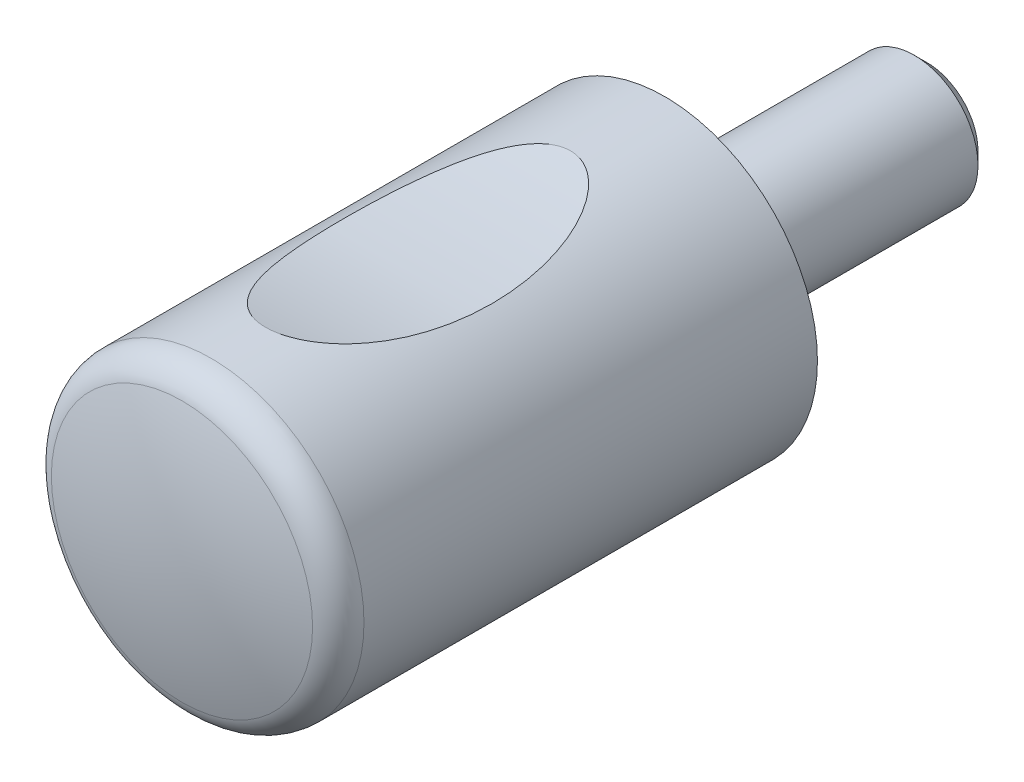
ISO-10303-21;
HEADER;
FILE_DESCRIPTION(('STEP AP214'),'2;1');
FILE_NAME('part.step','',(''),(''),'','','');
FILE_SCHEMA(('AUTOMOTIVE_DESIGN { 1 0 10303 214 1 1 1 1 }'));
ENDSEC;
DATA;
#1=APPLICATION_CONTEXT('core data for automotive mechanical design processes');
#2=APPLICATION_PROTOCOL_DEFINITION('international standard','automotive_design',2000,#1);
#3=PRODUCT_CONTEXT('',#1,'mechanical');
#4=PRODUCT('Part','Part','',(#3));
#5=PRODUCT_RELATED_PRODUCT_CATEGORY('part','',(#4));
#6=PRODUCT_DEFINITION_FORMATION('','',#4);
#7=PRODUCT_DEFINITION_CONTEXT('part definition',#1,'design');
#8=PRODUCT_DEFINITION('design','',#6,#7);
#9=PRODUCT_DEFINITION_SHAPE('','',#8);
#10=(LENGTH_UNIT() NAMED_UNIT(*) SI_UNIT(.MILLI.,.METRE.));
#11=(NAMED_UNIT(*) PLANE_ANGLE_UNIT() SI_UNIT($,.RADIAN.));
#12=(NAMED_UNIT(*) SI_UNIT($,.STERADIAN.) SOLID_ANGLE_UNIT());
#13=UNCERTAINTY_MEASURE_WITH_UNIT(LENGTH_MEASURE(1.E-05),#10,'distance_accuracy_value','');
#14=(GEOMETRIC_REPRESENTATION_CONTEXT(3) GLOBAL_UNCERTAINTY_ASSIGNED_CONTEXT((#13)) GLOBAL_UNIT_ASSIGNED_CONTEXT((#10,
#11,#12)) REPRESENTATION_CONTEXT('',''));
#15=CARTESIAN_POINT('',(0.,0.,0.));
#16=DIRECTION('',(0.,0.,1.));
#17=DIRECTION('',(1.,0.,0.));
#18=AXIS2_PLACEMENT_3D('',#15,#16,#17);
#19=CARTESIAN_POINT('',(0.,0.,20.));
#20=DIRECTION('',(0.,0.,1.));
#21=DIRECTION('',(1.,0.,0.));
#22=AXIS2_PLACEMENT_3D('',#19,#20,#21);
#23=CYLINDRICAL_SURFACE('',#22,6.);
#24=CARTESIAN_POINT('',(0.,0.,18.1207701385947));
#25=DIRECTION('',(0.,0.,1.));
#26=DIRECTION('',(1.,0.,0.));
#27=AXIS2_PLACEMENT_3D('',#24,#25,#26);
#28=CIRCLE('',#27,6.);
#29=CARTESIAN_POINT('',(6.,0.,18.1207701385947));
#30=VERTEX_POINT('',#29);
#31=EDGE_CURVE('E188',#30,#30,#28,.T.);
#32=ORIENTED_EDGE('',*,*,#31,.F.);
#33=EDGE_LOOP('',(#32));
#34=FACE_BOUND('',#33,.T.);
#35=CARTESIAN_POINT('',(0.,-6.,16.));
#36=CARTESIAN_POINT('',(-0.0885084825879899,-5.99999888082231,15.9999963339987));
#37=CARTESIAN_POINT('',(-0.177033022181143,-5.99802005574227,15.9922201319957));
#38=CARTESIAN_POINT('',(-0.35133626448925,-5.99034204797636,15.9618621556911));
#39=CARTESIAN_POINT('',(-0.43711286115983,-5.98464008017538,15.9392692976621));
#40=CARTESIAN_POINT('',(-0.603236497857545,-5.97017791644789,15.8814015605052));
#41=CARTESIAN_POINT('',(-0.683617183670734,-5.96143929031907,15.8462160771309));
#42=CARTESIAN_POINT('',(-0.838570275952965,-5.94162524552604,15.7654247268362));
#43=CARTESIAN_POINT('',(-0.913140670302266,-5.93054902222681,15.7198152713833));
#44=CARTESIAN_POINT('',(-1.10695132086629,-5.89830994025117,15.5850122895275));
#45=CARTESIAN_POINT('',(-1.22037159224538,-5.87556399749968,15.4878466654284));
#46=CARTESIAN_POINT('',(-1.43073393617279,-5.82792436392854,15.2774555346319));
#47=CARTESIAN_POINT('',(-1.52762016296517,-5.80302380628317,15.1641778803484));
#48=CARTESIAN_POINT('',(-1.69569048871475,-5.75597333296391,14.9418087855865));
#49=CARTESIAN_POINT('',(-1.76857378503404,-5.73386932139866,14.8339686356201));
#50=CARTESIAN_POINT('',(-1.90476176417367,-5.69007946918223,14.6122647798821));
#51=CARTESIAN_POINT('',(-1.96805898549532,-5.66839396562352,14.4983964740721));
#52=CARTESIAN_POINT('',(-2.08633341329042,-5.62593657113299,14.2660924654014));
#53=CARTESIAN_POINT('',(-2.14129910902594,-5.60516597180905,14.1476507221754));
#54=CARTESIAN_POINT('',(-2.24383352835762,-5.56491065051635,13.9073767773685));
#55=CARTESIAN_POINT('',(-2.29139954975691,-5.54542639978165,13.7855433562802));
#56=CARTESIAN_POINT('',(-2.41879687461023,-5.49159792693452,13.4313314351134));
#57=CARTESIAN_POINT('',(-2.49036250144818,-5.45919907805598,13.1956660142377));
#58=CARTESIAN_POINT('',(-2.61441516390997,-5.40087665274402,12.7185312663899));
#59=CARTESIAN_POINT('',(-2.66688604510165,-5.37495856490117,12.477057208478));
#60=CARTESIAN_POINT('',(-2.75538443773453,-5.33013287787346,11.9899723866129));
#61=CARTESIAN_POINT('',(-2.79137692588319,-5.31124022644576,11.7443539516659));
#62=CARTESIAN_POINT('',(-2.8484076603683,-5.28087145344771,11.2510432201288));
#63=CARTESIAN_POINT('',(-2.86945046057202,-5.2693930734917,11.0033515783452));
#64=CARTESIAN_POINT('',(-2.89873394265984,-5.25334667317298,10.4856281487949));
#65=CARTESIAN_POINT('',(-2.90572029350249,-5.24945660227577,10.2155042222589));
#66=CARTESIAN_POINT('',(-2.90353357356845,-5.25066575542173,9.67527182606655));
#67=CARTESIAN_POINT('',(-2.89435603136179,-5.25576746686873,9.40516338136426));
#68=CARTESIAN_POINT('',(-2.85942613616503,-5.27485410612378,8.86721784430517));
#69=CARTESIAN_POINT('',(-2.83372915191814,-5.28880935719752,8.59937618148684));
#70=CARTESIAN_POINT('',(-2.76450129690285,-5.32532347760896,8.0667184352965));
#71=CARTESIAN_POINT('',(-2.72097995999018,-5.34787774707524,7.8019008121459));
#72=CARTESIAN_POINT('',(-2.6148720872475,-5.40054921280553,7.28282189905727));
#73=CARTESIAN_POINT('',(-2.55272305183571,-5.43049033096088,7.02845639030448));
#74=CARTESIAN_POINT('',(-2.44216041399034,-5.48064370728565,6.65234346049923));
#75=CARTESIAN_POINT('',(-2.40234382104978,-5.49826538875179,6.52769619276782));
#76=CARTESIAN_POINT('',(-2.31627495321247,-5.53507666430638,6.28089251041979));
#77=CARTESIAN_POINT('',(-2.2700243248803,-5.55426585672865,6.15873546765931));
#78=CARTESIAN_POINT('',(-2.16968626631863,-5.59423046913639,5.9161243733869));
#79=CARTESIAN_POINT('',(-2.1155094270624,-5.61502249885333,5.79570975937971));
#80=CARTESIAN_POINT('',(-1.99870648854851,-5.65765364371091,5.55912422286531));
#81=CARTESIAN_POINT('',(-1.93607628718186,-5.67949326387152,5.44295539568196));
#82=CARTESIAN_POINT('',(-1.80147814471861,-5.72360661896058,5.21698841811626));
#83=CARTESIAN_POINT('',(-1.72955814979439,-5.74587765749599,5.10716147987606));
#84=CARTESIAN_POINT('',(-1.57477160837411,-5.79021374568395,4.89556756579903));
#85=CARTESIAN_POINT('',(-1.49192114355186,-5.81227904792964,4.79378909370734));
#86=CARTESIAN_POINT('',(-1.3292474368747,-5.85139401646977,4.61828011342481));
#87=CARTESIAN_POINT('',(-1.25142664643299,-5.8686461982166,4.54275669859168));
#88=CARTESIAN_POINT('',(-1.08642654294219,-5.90141932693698,4.40200371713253));
#89=CARTESIAN_POINT('',(-0.99924299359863,-5.9169394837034,4.33677884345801));
#90=CARTESIAN_POINT('',(-0.814239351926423,-5.94523918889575,4.21958141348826));
#91=CARTESIAN_POINT('',(-0.716301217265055,-5.9579825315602,4.16778243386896));
#92=CARTESIAN_POINT('',(-0.512085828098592,-5.97897963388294,4.0832197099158));
#93=CARTESIAN_POINT('',(-0.405830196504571,-5.98724461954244,4.05040835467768));
#94=CARTESIAN_POINT('',(-0.214619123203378,-5.99673247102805,4.01285794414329));
#95=CARTESIAN_POINT('',(-0.130668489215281,-5.99916902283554,4.00327291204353));
#96=CARTESIAN_POINT('',(0.0376884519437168,-6.00047075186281,3.99814556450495));
#97=CARTESIAN_POINT('',(0.122094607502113,-5.99933705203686,4.00259883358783));
#98=CARTESIAN_POINT('',(0.288704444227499,-5.99362939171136,4.02512989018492));
#99=CARTESIAN_POINT('',(0.370912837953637,-5.98906352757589,4.04317561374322));
#100=CARTESIAN_POINT('',(0.531437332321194,-5.97696188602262,4.09140204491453));
#101=CARTESIAN_POINT('',(0.609750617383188,-5.96942399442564,4.12159139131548));
#102=CARTESIAN_POINT('',(0.792980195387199,-5.94835106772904,4.20693915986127));
#103=CARTESIAN_POINT('',(0.895344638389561,-5.93362618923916,4.26725992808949));
#104=CARTESIAN_POINT('',(1.08894848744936,-5.90117761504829,4.4030591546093));
#105=CARTESIAN_POINT('',(1.18016058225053,-5.88344680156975,4.47857367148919));
#106=CARTESIAN_POINT('',(1.33472334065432,-5.85008083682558,4.62428816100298));
#107=CARTESIAN_POINT('',(1.40000393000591,-5.83473221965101,4.69254823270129));
#108=CARTESIAN_POINT('',(1.52426881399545,-5.80350772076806,4.83449592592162));
#109=CARTESIAN_POINT('',(1.58324910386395,-5.78763151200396,4.90818694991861));
#110=CARTESIAN_POINT('',(1.75175341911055,-5.73978249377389,5.13575119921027));
#111=CARTESIAN_POINT('',(1.85268549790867,-5.70762538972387,5.29596063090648));
#112=CARTESIAN_POINT('',(2.02917312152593,-5.64716355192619,5.61495923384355));
#113=CARTESIAN_POINT('',(2.10602364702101,-5.61874753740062,5.77303766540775));
#114=CARTESIAN_POINT('',(2.24621788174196,-5.5641856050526,6.09556739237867));
#115=CARTESIAN_POINT('',(2.30955019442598,-5.53804161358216,6.26002392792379));
#116=CARTESIAN_POINT('',(2.42470146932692,-5.48860162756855,6.59362294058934));
#117=CARTESIAN_POINT('',(2.47649921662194,-5.46531091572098,6.76277341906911));
#118=CARTESIAN_POINT('',(2.56992912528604,-5.42200101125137,7.1042907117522));
#119=CARTESIAN_POINT('',(2.6115580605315,-5.40198285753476,7.27665852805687));
#120=CARTESIAN_POINT('',(2.71249141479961,-5.35234018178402,7.74865687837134));
#121=CARTESIAN_POINT('',(2.76294374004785,-5.32617557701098,8.05056680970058));
#122=CARTESIAN_POINT('',(2.84079365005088,-5.28505089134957,8.65820096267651));
#123=CARTESIAN_POINT('',(2.86817404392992,-5.2700991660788,8.96392785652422));
#124=CARTESIAN_POINT('',(2.901664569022,-5.25173348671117,9.57723455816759));
#125=CARTESIAN_POINT('',(2.90774965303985,-5.24833311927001,9.88481612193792));
#126=CARTESIAN_POINT('',(2.89898713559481,-5.25318143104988,10.49945776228));
#127=CARTESIAN_POINT('',(2.88415027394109,-5.2614241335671,10.8065180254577));
#128=CARTESIAN_POINT('',(2.83955548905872,-5.28557926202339,11.3353207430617));
#129=CARTESIAN_POINT('',(2.81493178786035,-5.29880732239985,11.5576300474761));
#130=CARTESIAN_POINT('',(2.75313101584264,-5.33118217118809,12.0000487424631));
#131=CARTESIAN_POINT('',(2.71595660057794,-5.35032770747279,12.2201585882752));
#132=CARTESIAN_POINT('',(2.6278183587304,-5.39416247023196,12.6561122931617));
#133=CARTESIAN_POINT('',(2.57691236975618,-5.41882837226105,12.8719700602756));
#134=CARTESIAN_POINT('',(2.45918269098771,-5.47326722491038,13.2985713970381));
#135=CARTESIAN_POINT('',(2.39237027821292,-5.50303655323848,13.5093184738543));
#136=CARTESIAN_POINT('',(2.24738481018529,-5.56370379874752,13.9025920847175));
#137=CARTESIAN_POINT('',(2.17100752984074,-5.59419357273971,14.0858379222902));
#138=CARTESIAN_POINT('',(1.99941356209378,-5.65781017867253,14.4438077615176));
#139=CARTESIAN_POINT('',(1.90414151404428,-5.69094458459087,14.6185047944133));
#140=CARTESIAN_POINT('',(1.74321416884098,-5.74146190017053,14.8708131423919));
#141=CARTESIAN_POINT('',(1.68604624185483,-5.75857471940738,14.9539064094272));
#142=CARTESIAN_POINT('',(1.56504272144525,-5.79263390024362,15.1152445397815));
#143=CARTESIAN_POINT('',(1.50120408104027,-5.80958018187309,15.193487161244));
#144=CARTESIAN_POINT('',(1.36655154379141,-5.84271477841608,15.3431619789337));
#145=CARTESIAN_POINT('',(1.29577809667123,-5.85890676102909,15.4146293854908));
#146=CARTESIAN_POINT('',(1.14640128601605,-5.88995530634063,15.5491471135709));
#147=CARTESIAN_POINT('',(1.06780636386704,-5.9048132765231,15.6122063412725));
#148=CARTESIAN_POINT('',(0.906954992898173,-5.93158562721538,15.7241484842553));
#149=CARTESIAN_POINT('',(0.825130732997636,-5.9436162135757,15.7736162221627));
#150=CARTESIAN_POINT('',(0.654658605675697,-5.96479357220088,15.8597984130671));
#151=CARTESIAN_POINT('',(0.566019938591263,-5.97394415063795,15.896529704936));
#152=CARTESIAN_POINT('',(0.398209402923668,-5.98726321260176,15.9496769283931));
#153=CARTESIAN_POINT('',(0.319824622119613,-5.99199806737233,15.9684175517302));
#154=CARTESIAN_POINT('',(0.160963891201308,-5.99836649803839,15.9935788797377));
#155=CARTESIAN_POINT('',(0.0804885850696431,-6.00000101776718,16.000003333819));
#156=CARTESIAN_POINT('',(0.,-6.,16.));
#157=B_SPLINE_CURVE_WITH_KNOTS('',3,(#35,#36,#37,#38,#39,#40,#41,#42,#43,#44,#45,#46,#47,#48,
#49,#50,#51,#52,#53,#54,#55,#56,#57,#58,#59,#60,#61,#62,#63,#64,#65,#66,#67,#68,#69,#70,#71,#72,
#73,#74,#75,#76,#77,#78,#79,#80,#81,#82,#83,#84,#85,#86,#87,#88,#89,#90,#91,#92,#93,#94,#95,#96,
#97,#98,#99,#100,#101,#102,#103,#104,#105,#106,#107,#108,#109,#110,#111,#112,#113,#114,#115,
#116,#117,#118,#119,#120,#121,#122,#123,#124,#125,#126,#127,#128,#129,#130,#131,#132,#133,#134,
#135,#136,#137,#138,#139,#140,#141,#142,#143,#144,#145,#146,#147,#148,#149,#150,#151,#152,#153,
#154,#155,#156),.UNSPECIFIED.,.T.,.F.,(4,2,2,2,2,2,2,2,2,2,2,2,2,2,2,2,2,2,2,2,2,2,2,2,2,2,2,2,
2,2,2,2,2,2,2,2,2,2,2,2,2,2,2,2,2,2,2,2,2,2,2,2,2,2,2,2,2,2,2,2,4),(0.,0.265211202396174,
0.530621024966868,0.794182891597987,1.05783562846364,1.5084431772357,1.96054381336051,
2.35604569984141,2.75185386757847,3.14820399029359,3.54469851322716,4.28874758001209,
5.03342466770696,5.77967723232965,6.52570238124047,7.33578192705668,8.14608560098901,
8.95368741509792,9.76085782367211,10.5503858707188,10.9463350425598,11.3421830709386,
11.7429008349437,12.1438137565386,12.542734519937,12.9410747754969,13.2697834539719,
13.5986414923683,13.9315600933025,14.2636402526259,14.5160599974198,14.7684003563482,
15.0201473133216,15.2720736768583,15.6292319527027,15.9872480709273,16.2739171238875,
16.5607673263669,17.1351275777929,17.6686016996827,18.2025238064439,18.7374199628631,
19.2724855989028,20.1927732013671,21.1137459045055,22.0358014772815,22.9573839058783,
23.6291781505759,24.3008303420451,24.9696965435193,25.6380899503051,26.2398716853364,
26.8434433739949,27.1500871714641,27.4568716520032,27.7619626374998,28.0667278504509,
28.3549035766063,28.6426968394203,28.8839502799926,29.1251302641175),.UNSPECIFIED.);
#158=CARTESIAN_POINT('',(0.,-6.,16.));
#159=VERTEX_POINT('',#158);
#160=EDGE_CURVE('E9',#159,#159,#157,.T.);
#161=ORIENTED_EDGE('',*,*,#160,.F.);
#162=EDGE_LOOP('',(#161));
#163=FACE_BOUND('',#162,.T.);
#164=CARTESIAN_POINT('',(0.,6.,4.));
#165=CARTESIAN_POINT('',(-0.0885084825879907,5.99999888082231,4.00000366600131));
#166=CARTESIAN_POINT('',(-0.177033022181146,5.99802005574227,4.00777986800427));
#167=CARTESIAN_POINT('',(-0.351336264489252,5.99034204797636,4.0381378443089));
#168=CARTESIAN_POINT('',(-0.437112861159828,5.98464008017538,4.0607307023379));
#169=CARTESIAN_POINT('',(-0.603236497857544,5.97017791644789,4.1185984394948));
#170=CARTESIAN_POINT('',(-0.683617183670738,5.96143929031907,4.15378392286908));
#171=CARTESIAN_POINT('',(-0.838570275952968,5.94162524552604,4.23457527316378));
#172=CARTESIAN_POINT('',(-0.913140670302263,5.93054902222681,4.28018472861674));
#173=CARTESIAN_POINT('',(-1.10695132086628,5.89830994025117,4.41498771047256));
#174=CARTESIAN_POINT('',(-1.22037159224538,5.87556399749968,4.51215333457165));
#175=CARTESIAN_POINT('',(-1.43073393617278,5.82792436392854,4.72254446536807));
#176=CARTESIAN_POINT('',(-1.52762016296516,5.80302380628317,4.83582211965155));
#177=CARTESIAN_POINT('',(-1.69569048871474,5.75597333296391,5.05819121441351));
#178=CARTESIAN_POINT('',(-1.76857378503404,5.73386932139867,5.16603136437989));
#179=CARTESIAN_POINT('',(-1.90476176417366,5.69007946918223,5.38773522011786));
#180=CARTESIAN_POINT('',(-1.96805898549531,5.66839396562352,5.50160352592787));
#181=CARTESIAN_POINT('',(-2.08633341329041,5.62593657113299,5.73390753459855));
#182=CARTESIAN_POINT('',(-2.14129910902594,5.60516597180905,5.85234927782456));
#183=CARTESIAN_POINT('',(-2.24383352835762,5.56491065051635,6.09262322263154));
#184=CARTESIAN_POINT('',(-2.29139954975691,5.54542639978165,6.21445664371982));
#185=CARTESIAN_POINT('',(-2.41879687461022,5.49159792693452,6.56866856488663));
#186=CARTESIAN_POINT('',(-2.49036250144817,5.45919907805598,6.80433398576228));
#187=CARTESIAN_POINT('',(-2.61441516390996,5.40087665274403,7.28146873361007));
#188=CARTESIAN_POINT('',(-2.66688604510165,5.37495856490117,7.52294279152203));
#189=CARTESIAN_POINT('',(-2.75538443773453,5.33013287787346,8.01002761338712));
#190=CARTESIAN_POINT('',(-2.7913769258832,5.31124022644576,8.25564604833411));
#191=CARTESIAN_POINT('',(-2.8484076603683,5.28087145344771,8.74895677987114));
#192=CARTESIAN_POINT('',(-2.86945046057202,5.2693930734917,8.99664842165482));
#193=CARTESIAN_POINT('',(-2.89873394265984,5.25334667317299,9.51437185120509));
#194=CARTESIAN_POINT('',(-2.90572029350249,5.24945660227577,9.78449577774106));
#195=CARTESIAN_POINT('',(-2.90353357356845,5.25066575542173,10.3247281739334));
#196=CARTESIAN_POINT('',(-2.8943560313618,5.25576746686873,10.5948366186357));
#197=CARTESIAN_POINT('',(-2.85942613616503,5.27485410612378,11.1327821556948));
#198=CARTESIAN_POINT('',(-2.83372915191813,5.28880935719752,11.4006238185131));
#199=CARTESIAN_POINT('',(-2.76450129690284,5.32532347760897,11.9332815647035));
#200=CARTESIAN_POINT('',(-2.72097995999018,5.34787774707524,12.1980991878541));
#201=CARTESIAN_POINT('',(-2.6148720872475,5.40054921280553,12.7171781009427));
#202=CARTESIAN_POINT('',(-2.55272305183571,5.43049033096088,12.9715436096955));
#203=CARTESIAN_POINT('',(-2.44216041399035,5.48064370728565,13.3476565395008));
#204=CARTESIAN_POINT('',(-2.40234382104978,5.49826538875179,13.4723038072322));
#205=CARTESIAN_POINT('',(-2.31627495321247,5.53507666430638,13.7191074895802));
#206=CARTESIAN_POINT('',(-2.27002432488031,5.55426585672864,13.8412645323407));
#207=CARTESIAN_POINT('',(-2.16968626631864,5.59423046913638,14.0838756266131));
#208=CARTESIAN_POINT('',(-2.1155094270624,5.61502249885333,14.2042902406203));
#209=CARTESIAN_POINT('',(-1.9987064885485,5.65765364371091,14.4408757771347));
#210=CARTESIAN_POINT('',(-1.93607628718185,5.67949326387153,14.557044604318));
#211=CARTESIAN_POINT('',(-1.80147814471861,5.72360661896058,14.7830115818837));
#212=CARTESIAN_POINT('',(-1.72955814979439,5.74587765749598,14.8928385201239));
#213=CARTESIAN_POINT('',(-1.57477160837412,5.79021374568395,15.104432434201));
#214=CARTESIAN_POINT('',(-1.49192114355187,5.81227904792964,15.2062109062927));
#215=CARTESIAN_POINT('',(-1.3292474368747,5.85139401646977,15.3817198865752));
#216=CARTESIAN_POINT('',(-1.251426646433,5.8686461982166,15.4572433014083));
#217=CARTESIAN_POINT('',(-1.0864265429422,5.90141932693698,15.5979962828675));
#218=CARTESIAN_POINT('',(-0.99924299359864,5.9169394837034,15.663221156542));
#219=CARTESIAN_POINT('',(-0.814239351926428,5.94523918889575,15.7804185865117));
#220=CARTESIAN_POINT('',(-0.716301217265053,5.9579825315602,15.832217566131));
#221=CARTESIAN_POINT('',(-0.512085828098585,5.97897963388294,15.9167802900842));
#222=CARTESIAN_POINT('',(-0.405830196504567,5.98724461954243,15.9495916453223));
#223=CARTESIAN_POINT('',(-0.214619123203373,5.99673247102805,15.9871420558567));
#224=CARTESIAN_POINT('',(-0.130668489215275,5.99916902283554,15.9967270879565));
#225=CARTESIAN_POINT('',(0.0376884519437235,6.00047075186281,16.001854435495));
#226=CARTESIAN_POINT('',(0.12209460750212,5.99933705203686,15.9974011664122));
#227=CARTESIAN_POINT('',(0.288704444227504,5.99362939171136,15.9748701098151));
#228=CARTESIAN_POINT('',(0.370912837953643,5.98906352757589,15.9568243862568));
#229=CARTESIAN_POINT('',(0.531437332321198,5.97696188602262,15.9085979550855));
#230=CARTESIAN_POINT('',(0.609750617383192,5.96942399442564,15.8784086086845));
#231=CARTESIAN_POINT('',(0.792980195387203,5.94835106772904,15.7930608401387));
#232=CARTESIAN_POINT('',(0.895344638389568,5.93362618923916,15.7327400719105));
#233=CARTESIAN_POINT('',(1.08894848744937,5.90117761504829,15.5969408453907));
#234=CARTESIAN_POINT('',(1.18016058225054,5.88344680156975,15.5214263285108));
#235=CARTESIAN_POINT('',(1.33472334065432,5.85008083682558,15.375711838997));
#236=CARTESIAN_POINT('',(1.40000393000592,5.83473221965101,15.3074517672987));
#237=CARTESIAN_POINT('',(1.52426881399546,5.80350772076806,15.1655040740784));
#238=CARTESIAN_POINT('',(1.58324910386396,5.78763151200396,15.0918130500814));
#239=CARTESIAN_POINT('',(1.75175341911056,5.73978249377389,14.8642488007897));
#240=CARTESIAN_POINT('',(1.85268549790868,5.70762538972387,14.7040393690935));
#241=CARTESIAN_POINT('',(2.02917312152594,5.64716355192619,14.3850407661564));
#242=CARTESIAN_POINT('',(2.10602364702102,5.61874753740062,14.2269623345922));
#243=CARTESIAN_POINT('',(2.24621788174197,5.5641856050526,13.9044326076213));
#244=CARTESIAN_POINT('',(2.309550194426,5.53804161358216,13.7399760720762));
#245=CARTESIAN_POINT('',(2.42470146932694,5.48860162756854,13.4063770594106));
#246=CARTESIAN_POINT('',(2.47649921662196,5.46531091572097,13.2372265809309));
#247=CARTESIAN_POINT('',(2.56992912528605,5.42200101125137,12.8957092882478));
#248=CARTESIAN_POINT('',(2.61155806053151,5.40198285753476,12.7233414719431));
#249=CARTESIAN_POINT('',(2.7124914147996,5.35234018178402,12.2513431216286));
#250=CARTESIAN_POINT('',(2.76294374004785,5.32617557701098,11.9494331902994));
#251=CARTESIAN_POINT('',(2.84079365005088,5.28505089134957,11.3417990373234));
#252=CARTESIAN_POINT('',(2.86817404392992,5.27009916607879,11.0360721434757));
#253=CARTESIAN_POINT('',(2.901664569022,5.25173348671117,10.4227654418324));
#254=CARTESIAN_POINT('',(2.90774965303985,5.24833311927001,10.115183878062));
#255=CARTESIAN_POINT('',(2.8989871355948,5.25318143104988,9.50054223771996));
#256=CARTESIAN_POINT('',(2.88415027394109,5.26142413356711,9.19348197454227));
#257=CARTESIAN_POINT('',(2.83955548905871,5.2855792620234,8.66467925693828));
#258=CARTESIAN_POINT('',(2.81493178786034,5.29880732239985,8.44236995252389));
#259=CARTESIAN_POINT('',(2.75313101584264,5.33118217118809,7.99995125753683));
#260=CARTESIAN_POINT('',(2.71595660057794,5.35032770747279,7.77984141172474));
#261=CARTESIAN_POINT('',(2.6278183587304,5.39416247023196,7.34388770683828));
#262=CARTESIAN_POINT('',(2.57691236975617,5.41882837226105,7.12802993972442));
#263=CARTESIAN_POINT('',(2.4591826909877,5.47326722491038,6.70142860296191));
#264=CARTESIAN_POINT('',(2.39237027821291,5.50303655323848,6.49068152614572));
#265=CARTESIAN_POINT('',(2.24738481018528,5.56370379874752,6.09740791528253));
#266=CARTESIAN_POINT('',(2.17100752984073,5.59419357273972,5.91416207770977));
#267=CARTESIAN_POINT('',(1.99941356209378,5.65781017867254,5.55619223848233));
#268=CARTESIAN_POINT('',(1.90414151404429,5.69094458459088,5.38149520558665));
#269=CARTESIAN_POINT('',(1.74321416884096,5.74146190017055,5.12918685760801));
#270=CARTESIAN_POINT('',(1.68604624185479,5.75857471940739,5.04609359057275));
#271=CARTESIAN_POINT('',(1.56504272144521,5.79263390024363,4.88475546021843));
#272=CARTESIAN_POINT('',(1.50120408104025,5.80958018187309,4.80651283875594));
#273=CARTESIAN_POINT('',(1.36655154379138,5.84271477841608,4.65683802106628));
#274=CARTESIAN_POINT('',(1.29577809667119,5.8589067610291,4.58537061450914));
#275=CARTESIAN_POINT('',(1.146401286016,5.88995530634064,4.45085288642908));
#276=CARTESIAN_POINT('',(1.067806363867,5.90481327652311,4.38779365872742));
#277=CARTESIAN_POINT('',(0.906954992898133,5.93158562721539,4.27585151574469));
#278=CARTESIAN_POINT('',(0.825130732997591,5.9436162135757,4.22638377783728));
#279=CARTESIAN_POINT('',(0.654658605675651,5.96479357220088,4.14020158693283));
#280=CARTESIAN_POINT('',(0.566019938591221,5.97394415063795,4.103470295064));
#281=CARTESIAN_POINT('',(0.398209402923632,5.98726321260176,4.05032307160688));
#282=CARTESIAN_POINT('',(0.319824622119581,5.99199806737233,4.03158244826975));
#283=CARTESIAN_POINT('',(0.16096389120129,5.99836649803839,4.00642112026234));
#284=CARTESIAN_POINT('',(0.0804885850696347,6.00000101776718,3.99999666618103));
#285=CARTESIAN_POINT('',(0.,6.,4.));
#286=B_SPLINE_CURVE_WITH_KNOTS('',3,(#164,#165,#166,#167,#168,#169,#170,#171,#172,#173,#174,
#175,#176,#177,#178,#179,#180,#181,#182,#183,#184,#185,#186,#187,#188,#189,#190,#191,#192,#193,
#194,#195,#196,#197,#198,#199,#200,#201,#202,#203,#204,#205,#206,#207,#208,#209,#210,#211,#212,
#213,#214,#215,#216,#217,#218,#219,#220,#221,#222,#223,#224,#225,#226,#227,#228,#229,#230,#231,
#232,#233,#234,#235,#236,#237,#238,#239,#240,#241,#242,#243,#244,#245,#246,#247,#248,#249,#250,
#251,#252,#253,#254,#255,#256,#257,#258,#259,#260,#261,#262,#263,#264,#265,#266,#267,#268,#269,
#270,#271,#272,#273,#274,#275,#276,#277,#278,#279,#280,#281,#282,#283,#284,#285),.UNSPECIFIED.,
.T.,.F.,(4,2,2,2,2,2,2,2,2,2,2,2,2,2,2,2,2,2,2,2,2,2,2,2,2,2,2,2,2,2,2,2,2,2,2,2,2,2,2,2,2,2,2,
2,2,2,2,2,2,2,2,2,2,2,2,2,2,2,2,2,4),(0.,0.265211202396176,0.530621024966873,0.794182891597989,
1.05783562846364,1.50844317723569,1.96054381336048,2.35604569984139,2.75185386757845,
3.14820399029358,3.54469851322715,4.28874758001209,5.03342466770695,5.77967723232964,
6.52570238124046,7.33578192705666,8.14608560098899,8.9536874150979,9.76085782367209,
10.5503858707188,10.9463350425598,11.3421830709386,11.7429008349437,12.1438137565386,
12.542734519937,12.9410747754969,13.2697834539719,13.5986414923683,13.9315600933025,
14.2636402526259,14.5160599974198,14.7684003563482,15.0201473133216,15.2720736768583,
15.6292319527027,15.9872480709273,16.2739171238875,16.5607673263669,17.1351275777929,
17.6686016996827,18.2025238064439,18.7374199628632,19.2724855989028,20.1927732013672,
21.1137459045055,22.0358014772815,22.9573839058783,23.6291781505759,24.3008303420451,
24.9696965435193,25.6380899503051,26.2398716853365,26.843443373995,27.1500871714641,
27.4568716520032,27.7619626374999,28.0667278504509,28.3549035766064,28.6426968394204,
28.8839502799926,29.1251302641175),.UNSPECIFIED.);
#287=CARTESIAN_POINT('',(0.,6.,4.));
#288=VERTEX_POINT('',#287);
#289=EDGE_CURVE('E27',#288,#288,#286,.T.);
#290=ORIENTED_EDGE('',*,*,#289,.F.);
#291=EDGE_LOOP('',(#290));
#292=FACE_BOUND('',#291,.T.);
#293=CARTESIAN_POINT('',(0.,0.,0.3));
#294=DIRECTION('',(0.,0.,1.));
#295=DIRECTION('',(1.,0.,0.));
#296=AXIS2_PLACEMENT_3D('',#293,#294,#295);
#297=CIRCLE('',#296,6.);
#298=CARTESIAN_POINT('',(6.,0.,0.3));
#299=VERTEX_POINT('',#298);
#300=EDGE_CURVE('E191',#299,#299,#297,.T.);
#301=ORIENTED_EDGE('',*,*,#300,.T.);
#302=EDGE_LOOP('',(#301));
#303=FACE_BOUND('',#302,.T.);
#304=ADVANCED_FACE('F14',(#34,#163,#292,#303),#23,.T.);
#305=CARTESIAN_POINT('',(0.,0.,-7.5));
#306=DIRECTION('',(0.,0.,1.));
#307=DIRECTION('',(1.,0.,0.));
#308=AXIS2_PLACEMENT_3D('',#305,#306,#307);
#309=PLANE('',#308);
#310=CARTESIAN_POINT('',(0.,0.,-7.5));
#311=DIRECTION('',(0.,0.,1.));
#312=DIRECTION('',(1.,0.,0.));
#313=AXIS2_PLACEMENT_3D('',#310,#311,#312);
#314=CIRCLE('',#313,1.25);
#315=CARTESIAN_POINT('',(0.625,-1.08253175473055,-7.5));
#316=VERTEX_POINT('',#315);
#317=CARTESIAN_POINT('',(-0.625,-1.08253175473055,-7.5));
#318=VERTEX_POINT('',#317);
#319=EDGE_CURVE('E200',#316,#318,#314,.F.);
#320=ORIENTED_EDGE('',*,*,#319,.F.);
#321=DIRECTION('',(0.866025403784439,0.5,0.));
#322=VECTOR('',#321,1.);
#323=CARTESIAN_POINT('',(0.,-1.44337567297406,-7.5));
#324=LINE('',#323,#322);
#325=CARTESIAN_POINT('',(0.,-1.44337567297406,-7.5));
#326=VERTEX_POINT('',#325);
#327=EDGE_CURVE('E130',#326,#316,#324,.T.);
#328=ORIENTED_EDGE('',*,*,#327,.F.);
#329=DIRECTION('',(0.866025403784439,-0.5,0.));
#330=VECTOR('',#329,1.);
#331=CARTESIAN_POINT('',(-1.25,-0.721687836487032,-7.5));
#332=LINE('',#331,#330);
#333=EDGE_CURVE('E125',#318,#326,#332,.T.);
#334=ORIENTED_EDGE('',*,*,#333,.F.);
#335=EDGE_LOOP('',(#320,#328,#334));
#336=FACE_BOUND('',#335,.T.);
#337=ADVANCED_FACE('F215',(#336),#309,.F.);
#338=CARTESIAN_POINT('',(-1.25,0.,-7.5));
#339=VERTEX_POINT('',#338);
#340=EDGE_CURVE('E102',#318,#339,#314,.F.);
#341=ORIENTED_EDGE('',*,*,#340,.F.);
#342=CARTESIAN_POINT('',(-1.25,-0.721687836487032,-7.5));
#343=VERTEX_POINT('',#342);
#344=EDGE_CURVE('E126',#343,#318,#332,.T.);
#345=ORIENTED_EDGE('',*,*,#344,.F.);
#346=DIRECTION('',(0.,-1.,0.));
#347=VECTOR('',#346,1.);
#348=CARTESIAN_POINT('',(-1.25,0.721687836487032,-7.5));
#349=LINE('',#348,#347);
#350=EDGE_CURVE('E122',#339,#343,#349,.T.);
#351=ORIENTED_EDGE('',*,*,#350,.F.);
#352=EDGE_LOOP('',(#341,#345,#351));
#353=FACE_BOUND('',#352,.T.);
#354=ADVANCED_FACE('F218',(#353),#309,.F.);
#355=CARTESIAN_POINT('',(-0.625,1.08253175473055,-7.5));
#356=VERTEX_POINT('',#355);
#357=EDGE_CURVE('E99',#339,#356,#314,.F.);
#358=ORIENTED_EDGE('',*,*,#357,.F.);
#359=CARTESIAN_POINT('',(-1.25,0.721687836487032,-7.5));
#360=VERTEX_POINT('',#359);
#361=EDGE_CURVE('E112',#360,#339,#349,.T.);
#362=ORIENTED_EDGE('',*,*,#361,.F.);
#363=DIRECTION('',(-0.866025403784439,-0.5,0.));
#364=VECTOR('',#363,1.);
#365=CARTESIAN_POINT('',(0.,1.44337567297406,-7.5));
#366=LINE('',#365,#364);
#367=EDGE_CURVE('E108',#356,#360,#366,.T.);
#368=ORIENTED_EDGE('',*,*,#367,.F.);
#369=EDGE_LOOP('',(#358,#362,#368));
#370=FACE_BOUND('',#369,.T.);
#371=ADVANCED_FACE('F110',(#370),#309,.F.);
#372=CARTESIAN_POINT('',(0.625,1.08253175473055,-7.5));
#373=VERTEX_POINT('',#372);
#374=EDGE_CURVE('E34',#356,#373,#314,.F.);
#375=ORIENTED_EDGE('',*,*,#374,.F.);
#376=CARTESIAN_POINT('',(0.,1.44337567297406,-7.5));
#377=VERTEX_POINT('',#376);
#378=EDGE_CURVE('E114',#377,#356,#366,.T.);
#379=ORIENTED_EDGE('',*,*,#378,.F.);
#380=DIRECTION('',(-0.866025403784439,0.5,0.));
#381=VECTOR('',#380,1.);
#382=CARTESIAN_POINT('',(1.25,0.721687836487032,-7.5));
#383=LINE('',#382,#381);
#384=EDGE_CURVE('E137',#373,#377,#383,.T.);
#385=ORIENTED_EDGE('',*,*,#384,.F.);
#386=EDGE_LOOP('',(#375,#379,#385));
#387=FACE_BOUND('',#386,.T.);
#388=ADVANCED_FACE('F318',(#387),#309,.F.);
#389=CARTESIAN_POINT('',(1.25,0.,-7.5));
#390=VERTEX_POINT('',#389);
#391=EDGE_CURVE('E106',#390,#316,#314,.F.);
#392=ORIENTED_EDGE('',*,*,#391,.F.);
#393=DIRECTION('',(0.,1.,0.));
#394=VECTOR('',#393,1.);
#395=CARTESIAN_POINT('',(1.25,-0.721687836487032,-7.5));
#396=LINE('',#395,#394);
#397=CARTESIAN_POINT('',(1.25,-0.721687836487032,-7.5));
#398=VERTEX_POINT('',#397);
#399=EDGE_CURVE('E134',#398,#390,#396,.T.);
#400=ORIENTED_EDGE('',*,*,#399,.F.);
#401=EDGE_CURVE('E129',#316,#398,#324,.T.);
#402=ORIENTED_EDGE('',*,*,#401,.F.);
#403=EDGE_LOOP('',(#392,#400,#402));
#404=FACE_BOUND('',#403,.T.);
#405=ADVANCED_FACE('F327',(#404),#309,.F.);
#406=EDGE_CURVE('E199',#373,#390,#314,.F.);
#407=ORIENTED_EDGE('',*,*,#406,.F.);
#408=CARTESIAN_POINT('',(1.25,0.721687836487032,-7.5));
#409=VERTEX_POINT('',#408);
#410=EDGE_CURVE('E138',#409,#373,#383,.T.);
#411=ORIENTED_EDGE('',*,*,#410,.F.);
#412=EDGE_CURVE('E133',#390,#409,#396,.T.);
#413=ORIENTED_EDGE('',*,*,#412,.F.);
#414=EDGE_LOOP('',(#407,#411,#413));
#415=FACE_BOUND('',#414,.T.);
#416=ADVANCED_FACE('F220',(#415),#309,.F.);
#417=CARTESIAN_POINT('',(0.,0.,-10.));
#418=DIRECTION('',(0.,0.,1.));
#419=DIRECTION('',(1.,0.,0.));
#420=AXIS2_PLACEMENT_3D('',#417,#418,#419);
#421=PLANE('',#420);
#422=CARTESIAN_POINT('',(0.,0.,-10.));
#423=DIRECTION('',(0.,0.,1.));
#424=DIRECTION('',(1.,0.,0.));
#425=AXIS2_PLACEMENT_3D('',#422,#423,#424);
#426=CIRCLE('',#425,2.0095);
#427=CARTESIAN_POINT('',(2.0095,0.,-10.));
#428=VERTEX_POINT('',#427);
#429=EDGE_CURVE('E182',#428,#428,#426,.T.);
#430=ORIENTED_EDGE('',*,*,#429,.F.);
#431=EDGE_LOOP('',(#430));
#432=FACE_BOUND('',#431,.T.);
#433=DIRECTION('',(-0.866025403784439,-0.5,0.));
#434=VECTOR('',#433,1.);
#435=CARTESIAN_POINT('',(0.,1.44337567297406,-10.));
#436=LINE('',#435,#434);
#437=CARTESIAN_POINT('',(0.,1.44337567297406,-10.));
#438=VERTEX_POINT('',#437);
#439=CARTESIAN_POINT('',(-1.25,0.721687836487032,-10.));
#440=VERTEX_POINT('',#439);
#441=EDGE_CURVE('E42',#438,#440,#436,.T.);
#442=ORIENTED_EDGE('',*,*,#441,.T.);
#443=DIRECTION('',(0.,-1.,0.));
#444=VECTOR('',#443,1.);
#445=CARTESIAN_POINT('',(-1.25,0.721687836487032,-10.));
#446=LINE('',#445,#444);
#447=CARTESIAN_POINT('',(-1.25,-0.721687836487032,-10.));
#448=VERTEX_POINT('',#447);
#449=EDGE_CURVE('E142',#440,#448,#446,.T.);
#450=ORIENTED_EDGE('',*,*,#449,.T.);
#451=DIRECTION('',(0.866025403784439,-0.5,0.));
#452=VECTOR('',#451,1.);
#453=CARTESIAN_POINT('',(-1.25,-0.721687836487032,-10.));
#454=LINE('',#453,#452);
#455=CARTESIAN_POINT('',(0.,-1.44337567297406,-10.));
#456=VERTEX_POINT('',#455);
#457=EDGE_CURVE('E145',#448,#456,#454,.T.);
#458=ORIENTED_EDGE('',*,*,#457,.T.);
#459=DIRECTION('',(0.866025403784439,0.5,0.));
#460=VECTOR('',#459,1.);
#461=CARTESIAN_POINT('',(0.,-1.44337567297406,-10.));
#462=LINE('',#461,#460);
#463=CARTESIAN_POINT('',(1.25,-0.721687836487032,-10.));
#464=VERTEX_POINT('',#463);
#465=EDGE_CURVE('E148',#456,#464,#462,.T.);
#466=ORIENTED_EDGE('',*,*,#465,.T.);
#467=DIRECTION('',(0.,1.,0.));
#468=VECTOR('',#467,1.);
#469=CARTESIAN_POINT('',(1.25,-0.721687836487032,-10.));
#470=LINE('',#469,#468);
#471=CARTESIAN_POINT('',(1.25,0.721687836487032,-10.));
#472=VERTEX_POINT('',#471);
#473=EDGE_CURVE('E151',#464,#472,#470,.T.);
#474=ORIENTED_EDGE('',*,*,#473,.T.);
#475=DIRECTION('',(-0.866025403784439,0.5,0.));
#476=VECTOR('',#475,1.);
#477=CARTESIAN_POINT('',(1.25,0.721687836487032,-10.));
#478=LINE('',#477,#476);
#479=EDGE_CURVE('E115',#472,#438,#478,.T.);
#480=ORIENTED_EDGE('',*,*,#479,.T.);
#481=EDGE_LOOP('',(#442,#450,#458,#466,#474,#480));
#482=FACE_BOUND('',#481,.T.);
#483=ADVANCED_FACE('F263',(#432,#482),#421,.F.);
#484=CARTESIAN_POINT('',(0.,0.,0.));
#485=DIRECTION('',(0.,0.,1.));
#486=DIRECTION('',(1.,0.,0.));
#487=AXIS2_PLACEMENT_3D('',#484,#485,#486);
#488=PLANE('',#487);
#489=CARTESIAN_POINT('',(0.,0.,0.));
#490=DIRECTION('',(0.,0.,1.));
#491=DIRECTION('',(1.,0.,0.));
#492=AXIS2_PLACEMENT_3D('',#489,#490,#491);
#493=CIRCLE('',#492,3.25);
#494=CARTESIAN_POINT('',(3.25,0.,0.));
#495=VERTEX_POINT('',#494);
#496=EDGE_CURVE('E197',#495,#495,#493,.T.);
#497=ORIENTED_EDGE('',*,*,#496,.F.);
#498=EDGE_LOOP('',(#497));
#499=FACE_BOUND('',#498,.T.);
#500=CARTESIAN_POINT('',(0.,0.,0.));
#501=DIRECTION('',(0.,0.,1.));
#502=DIRECTION('',(1.,0.,0.));
#503=AXIS2_PLACEMENT_3D('',#500,#501,#502);
#504=CIRCLE('',#503,1.9);
#505=CARTESIAN_POINT('',(1.9,0.,0.));
#506=VERTEX_POINT('',#505);
#507=EDGE_CURVE('E167',#506,#506,#504,.T.);
#508=ORIENTED_EDGE('',*,*,#507,.T.);
#509=EDGE_LOOP('',(#508));
#510=FACE_BOUND('',#509,.T.);
#511=ADVANCED_FACE('F16',(#499,#510),#488,.F.);
#512=CARTESIAN_POINT('',(0.,0.,20.));
#513=DIRECTION('',(0.,0.,1.));
#514=DIRECTION('',(1.,0.,0.));
#515=AXIS2_PLACEMENT_3D('',#512,#513,#514);
#516=CYLINDRICAL_SURFACE('',#515,3.25);
#517=CARTESIAN_POINT('',(0.,0.,0.3));
#518=DIRECTION('',(0.,0.,1.));
#519=DIRECTION('',(1.,0.,0.));
#520=AXIS2_PLACEMENT_3D('',#517,#518,#519);
#521=CIRCLE('',#520,3.25);
#522=CARTESIAN_POINT('',(3.25,0.,0.3));
#523=VERTEX_POINT('',#522);
#524=EDGE_CURVE('E194',#523,#523,#521,.T.);
#525=ORIENTED_EDGE('',*,*,#524,.F.);
#526=EDGE_LOOP('',(#525));
#527=FACE_BOUND('',#526,.T.);
#528=ORIENTED_EDGE('',*,*,#496,.T.);
#529=EDGE_LOOP('',(#528));
#530=FACE_BOUND('',#529,.T.);
#531=ADVANCED_FACE('F278',(#527,#530),#516,.T.);
#532=CARTESIAN_POINT('',(0.,3.25,0.3));
#533=DIRECTION('',(0.,0.,1.));
#534=DIRECTION('',(1.,0.,0.));
#535=AXIS2_PLACEMENT_3D('',#532,#533,#534);
#536=PLANE('',#535);
#537=ORIENTED_EDGE('',*,*,#300,.F.);
#538=EDGE_LOOP('',(#537));
#539=FACE_BOUND('',#538,.T.);
#540=ORIENTED_EDGE('',*,*,#524,.T.);
#541=EDGE_LOOP('',(#540));
#542=FACE_BOUND('',#541,.T.);
#543=ADVANCED_FACE('F271',(#539,#542),#536,.F.);
#544=CARTESIAN_POINT('',(0.,0.,18.1207701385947));
#545=DIRECTION('',(0.,0.,1.));
#546=DIRECTION('',(1.,0.,0.));
#547=AXIS2_PLACEMENT_3D('',#544,#545,#546);
#548=TOROIDAL_SURFACE('',#547,4.8,1.2);
#549=ORIENTED_EDGE('',*,*,#31,.T.);
#550=EDGE_LOOP('',(#549));
#551=FACE_BOUND('',#550,.T.);
#552=CARTESIAN_POINT('',(0.,0.,19.2736559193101));
#553=DIRECTION('',(0.,0.,1.));
#554=DIRECTION('',(1.,0.,0.));
#555=AXIS2_PLACEMENT_3D('',#552,#553,#554);
#556=CIRCLE('',#555,5.13294800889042);
#557=CARTESIAN_POINT('',(5.13294800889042,0.,19.2736559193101));
#558=VERTEX_POINT('',#557);
#559=EDGE_CURVE('E185',#558,#558,#556,.T.);
#560=ORIENTED_EDGE('',*,*,#559,.F.);
#561=EDGE_LOOP('',(#560));
#562=FACE_BOUND('',#561,.T.);
#563=ADVANCED_FACE('F268',(#551,#562),#548,.T.);
#564=CARTESIAN_POINT('',(0.,0.,1.5));
#565=DIRECTION('',(0.,0.,1.));
#566=DIRECTION('',(0.,-1.,0.));
#567=AXIS2_PLACEMENT_3D('',#564,#565,#566);
#568=SPHERICAL_SURFACE('',#567,18.5);
#569=ORIENTED_EDGE('',*,*,#559,.T.);
#570=EDGE_LOOP('',(#569));
#571=FACE_BOUND('',#570,.T.);
#572=ADVANCED_FACE('F261',(#571),#568,.T.);
#573=CARTESIAN_POINT('',(0.,0.,-10.));
#574=DIRECTION('',(0.,0.,1.));
#575=DIRECTION('',(1.,0.,0.));
#576=AXIS2_PLACEMENT_3D('',#573,#574,#575);
#577=CONICAL_SURFACE('',#576,2.0095,0.785398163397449);
#578=CARTESIAN_POINT('',(0.,0.,-9.5095));
#579=DIRECTION('',(0.,0.,1.));
#580=DIRECTION('',(1.,0.,0.));
#581=AXIS2_PLACEMENT_3D('',#578,#579,#580);
#582=CIRCLE('',#581,2.5);
#583=CARTESIAN_POINT('',(2.5,0.,-9.5095));
#584=VERTEX_POINT('',#583);
#585=EDGE_CURVE('E179',#584,#584,#582,.T.);
#586=ORIENTED_EDGE('',*,*,#585,.F.);
#587=EDGE_LOOP('',(#586));
#588=FACE_BOUND('',#587,.T.);
#589=ORIENTED_EDGE('',*,*,#429,.T.);
#590=EDGE_LOOP('',(#589));
#591=FACE_BOUND('',#590,.T.);
#592=ADVANCED_FACE('F257',(#588,#591),#577,.T.);
#593=CARTESIAN_POINT('',(0.,0.,0.));
#594=DIRECTION('',(0.,0.,1.));
#595=DIRECTION('',(1.,0.,0.));
#596=AXIS2_PLACEMENT_3D('',#593,#594,#595);
#597=CYLINDRICAL_SURFACE('',#596,2.5);
#598=CARTESIAN_POINT('',(0.,0.,-1.4905));
#599=DIRECTION('',(0.,0.,1.));
#600=DIRECTION('',(1.,0.,0.));
#601=AXIS2_PLACEMENT_3D('',#598,#599,#600);
#602=CIRCLE('',#601,2.5);
#603=CARTESIAN_POINT('',(2.5,0.,-1.4905));
#604=VERTEX_POINT('',#603);
#605=EDGE_CURVE('E176',#604,#604,#602,.T.);
#606=ORIENTED_EDGE('',*,*,#605,.F.);
#607=EDGE_LOOP('',(#606));
#608=FACE_BOUND('',#607,.T.);
#609=ORIENTED_EDGE('',*,*,#585,.T.);
#610=EDGE_LOOP('',(#609));
#611=FACE_BOUND('',#610,.T.);
#612=ADVANCED_FACE('F253',(#608,#611),#597,.T.);
#613=CARTESIAN_POINT('',(0.,0.,-1.4905));
#614=DIRECTION('',(0.,0.,-1.));
#615=DIRECTION('',(-1.,0.,0.));
#616=AXIS2_PLACEMENT_3D('',#613,#614,#615);
#617=CONICAL_SURFACE('',#616,2.5,0.785398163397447);
#618=CARTESIAN_POINT('',(0.,0.,-1.));
#619=DIRECTION('',(0.,0.,1.));
#620=DIRECTION('',(1.,0.,0.));
#621=AXIS2_PLACEMENT_3D('',#618,#619,#620);
#622=CIRCLE('',#621,2.0095);
#623=CARTESIAN_POINT('',(2.0095,0.,-1.));
#624=VERTEX_POINT('',#623);
#625=EDGE_CURVE('E173',#624,#624,#622,.T.);
#626=ORIENTED_EDGE('',*,*,#625,.F.);
#627=EDGE_LOOP('',(#626));
#628=FACE_BOUND('',#627,.T.);
#629=ORIENTED_EDGE('',*,*,#605,.T.);
#630=EDGE_LOOP('',(#629));
#631=FACE_BOUND('',#630,.T.);
#632=ADVANCED_FACE('F249',(#628,#631),#617,.T.);
#633=CARTESIAN_POINT('',(0.,2.0095,-1.));
#634=DIRECTION('',(0.,0.,-1.));
#635=DIRECTION('',(-1.,0.,0.));
#636=AXIS2_PLACEMENT_3D('',#633,#634,#635);
#637=PLANE('',#636);
#638=CARTESIAN_POINT('',(0.,0.,-1.));
#639=DIRECTION('',(0.,0.,1.));
#640=DIRECTION('',(1.,0.,0.));
#641=AXIS2_PLACEMENT_3D('',#638,#639,#640);
#642=CIRCLE('',#641,1.9);
#643=CARTESIAN_POINT('',(1.9,0.,-1.));
#644=VERTEX_POINT('',#643);
#645=EDGE_CURVE('E170',#644,#644,#642,.T.);
#646=ORIENTED_EDGE('',*,*,#645,.F.);
#647=EDGE_LOOP('',(#646));
#648=FACE_BOUND('',#647,.T.);
#649=ORIENTED_EDGE('',*,*,#625,.T.);
#650=EDGE_LOOP('',(#649));
#651=FACE_BOUND('',#650,.T.);
#652=ADVANCED_FACE('F245',(#648,#651),#637,.F.);
#653=CARTESIAN_POINT('',(0.,0.,0.));
#654=DIRECTION('',(0.,0.,1.));
#655=DIRECTION('',(1.,0.,0.));
#656=AXIS2_PLACEMENT_3D('',#653,#654,#655);
#657=CYLINDRICAL_SURFACE('',#656,1.9);
#658=ORIENTED_EDGE('',*,*,#507,.F.);
#659=EDGE_LOOP('',(#658));
#660=FACE_BOUND('',#659,.T.);
#661=ORIENTED_EDGE('',*,*,#645,.T.);
#662=EDGE_LOOP('',(#661));
#663=FACE_BOUND('',#662,.T.);
#664=ADVANCED_FACE('F242',(#660,#663),#657,.T.);
#665=CARTESIAN_POINT('',(0.,1.44337567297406,-7.5));
#666=DIRECTION('',(0.5,-0.866025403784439,0.));
#667=DIRECTION('',(0.866025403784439,0.5,0.));
#668=AXIS2_PLACEMENT_3D('',#665,#666,#667);
#669=PLANE('',#668);
#670=ORIENTED_EDGE('',*,*,#441,.F.);
#671=DIRECTION('',(0.,0.,-1.));
#672=VECTOR('',#671,1.);
#673=CARTESIAN_POINT('',(0.,1.44337567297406,-7.5));
#674=LINE('',#673,#672);
#675=EDGE_CURVE('E119',#377,#438,#674,.T.);
#676=ORIENTED_EDGE('',*,*,#675,.F.);
#677=ORIENTED_EDGE('',*,*,#378,.T.);
#678=ORIENTED_EDGE('',*,*,#367,.T.);
#679=DIRECTION('',(0.,0.,-1.));
#680=VECTOR('',#679,1.);
#681=CARTESIAN_POINT('',(-1.25,0.721687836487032,-7.5));
#682=LINE('',#681,#680);
#683=EDGE_CURVE('E165',#360,#440,#682,.T.);
#684=ORIENTED_EDGE('',*,*,#683,.T.);
#685=EDGE_LOOP('',(#670,#676,#677,#678,#684));
#686=FACE_BOUND('',#685,.T.);
#687=ADVANCED_FACE('F118',(#686),#669,.T.);
#688=CARTESIAN_POINT('',(-1.25,0.721687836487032,-7.5));
#689=DIRECTION('',(1.,0.,0.));
#690=DIRECTION('',(0.,0.,-1.));
#691=AXIS2_PLACEMENT_3D('',#688,#689,#690);
#692=PLANE('',#691);
#693=ORIENTED_EDGE('',*,*,#449,.F.);
#694=ORIENTED_EDGE('',*,*,#683,.F.);
#695=ORIENTED_EDGE('',*,*,#361,.T.);
#696=ORIENTED_EDGE('',*,*,#350,.T.);
#697=DIRECTION('',(0.,0.,-1.));
#698=VECTOR('',#697,1.);
#699=CARTESIAN_POINT('',(-1.25,-0.721687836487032,-7.5));
#700=LINE('',#699,#698);
#701=EDGE_CURVE('E163',#343,#448,#700,.T.);
#702=ORIENTED_EDGE('',*,*,#701,.T.);
#703=EDGE_LOOP('',(#693,#694,#695,#696,#702));
#704=FACE_BOUND('',#703,.T.);
#705=ADVANCED_FACE('F235',(#704),#692,.T.);
#706=CARTESIAN_POINT('',(-1.25,-0.721687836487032,-7.5));
#707=DIRECTION('',(0.5,0.866025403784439,0.));
#708=DIRECTION('',(-0.866025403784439,0.5,0.));
#709=AXIS2_PLACEMENT_3D('',#706,#707,#708);
#710=PLANE('',#709);
#711=ORIENTED_EDGE('',*,*,#457,.F.);
#712=ORIENTED_EDGE('',*,*,#701,.F.);
#713=ORIENTED_EDGE('',*,*,#344,.T.);
#714=ORIENTED_EDGE('',*,*,#333,.T.);
#715=DIRECTION('',(0.,0.,-1.));
#716=VECTOR('',#715,1.);
#717=CARTESIAN_POINT('',(0.,-1.44337567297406,-7.5));
#718=LINE('',#717,#716);
#719=EDGE_CURVE('E161',#326,#456,#718,.T.);
#720=ORIENTED_EDGE('',*,*,#719,.T.);
#721=EDGE_LOOP('',(#711,#712,#713,#714,#720));
#722=FACE_BOUND('',#721,.T.);
#723=ADVANCED_FACE('F231',(#722),#710,.T.);
#724=CARTESIAN_POINT('',(0.,-1.44337567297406,-7.5));
#725=DIRECTION('',(-0.5,0.866025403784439,0.));
#726=DIRECTION('',(-0.866025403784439,-0.5,0.));
#727=AXIS2_PLACEMENT_3D('',#724,#725,#726);
#728=PLANE('',#727);
#729=ORIENTED_EDGE('',*,*,#465,.F.);
#730=ORIENTED_EDGE('',*,*,#719,.F.);
#731=ORIENTED_EDGE('',*,*,#327,.T.);
#732=ORIENTED_EDGE('',*,*,#401,.T.);
#733=DIRECTION('',(0.,0.,-1.));
#734=VECTOR('',#733,1.);
#735=CARTESIAN_POINT('',(1.25,-0.721687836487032,-7.5));
#736=LINE('',#735,#734);
#737=EDGE_CURVE('E159',#398,#464,#736,.T.);
#738=ORIENTED_EDGE('',*,*,#737,.T.);
#739=EDGE_LOOP('',(#729,#730,#731,#732,#738));
#740=FACE_BOUND('',#739,.T.);
#741=ADVANCED_FACE('F227',(#740),#728,.T.);
#742=CARTESIAN_POINT('',(1.25,-0.721687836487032,-7.5));
#743=DIRECTION('',(-1.,0.,0.));
#744=DIRECTION('',(0.,0.,1.));
#745=AXIS2_PLACEMENT_3D('',#742,#743,#744);
#746=PLANE('',#745);
#747=ORIENTED_EDGE('',*,*,#473,.F.);
#748=ORIENTED_EDGE('',*,*,#737,.F.);
#749=ORIENTED_EDGE('',*,*,#399,.T.);
#750=ORIENTED_EDGE('',*,*,#412,.T.);
#751=DIRECTION('',(0.,0.,-1.));
#752=VECTOR('',#751,1.);
#753=CARTESIAN_POINT('',(1.25,0.721687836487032,-7.5));
#754=LINE('',#753,#752);
#755=EDGE_CURVE('E157',#409,#472,#754,.T.);
#756=ORIENTED_EDGE('',*,*,#755,.T.);
#757=EDGE_LOOP('',(#747,#748,#749,#750,#756));
#758=FACE_BOUND('',#757,.T.);
#759=ADVANCED_FACE('F223',(#758),#746,.T.);
#760=CARTESIAN_POINT('',(1.25,0.721687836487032,-7.5));
#761=DIRECTION('',(-0.5,-0.866025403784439,0.));
#762=DIRECTION('',(0.866025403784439,-0.5,0.));
#763=AXIS2_PLACEMENT_3D('',#760,#761,#762);
#764=PLANE('',#763);
#765=ORIENTED_EDGE('',*,*,#479,.F.);
#766=ORIENTED_EDGE('',*,*,#755,.F.);
#767=ORIENTED_EDGE('',*,*,#410,.T.);
#768=ORIENTED_EDGE('',*,*,#384,.T.);
#769=ORIENTED_EDGE('',*,*,#675,.T.);
#770=EDGE_LOOP('',(#765,#766,#767,#768,#769));
#771=FACE_BOUND('',#770,.T.);
#772=ADVANCED_FACE('F96',(#771),#764,.T.);
#773=CARTESIAN_POINT('',(0.,0.,-7.5));
#774=DIRECTION('',(0.,0.,-1.));
#775=DIRECTION('',(-1.,0.,0.));
#776=AXIS2_PLACEMENT_3D('',#773,#774,#775);
#777=CONICAL_SURFACE('',#776,1.25,1.0471975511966);
#778=CARTESIAN_POINT('',(0.,0.,-6.77831216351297));
#779=VERTEX_POINT('',#778);
#780=VERTEX_LOOP('',#779);
#781=FACE_BOUND('',#780,.T.);
#782=ORIENTED_EDGE('',*,*,#357,.T.);
#783=ORIENTED_EDGE('',*,*,#374,.T.);
#784=ORIENTED_EDGE('',*,*,#406,.T.);
#785=ORIENTED_EDGE('',*,*,#391,.T.);
#786=ORIENTED_EDGE('',*,*,#319,.T.);
#787=ORIENTED_EDGE('',*,*,#340,.T.);
#788=EDGE_LOOP('',(#782,#783,#784,#785,#786,#787));
#789=FACE_BOUND('',#788,.T.);
#790=ADVANCED_FACE('F93',(#781,#789),#777,.F.);
#791=CARTESIAN_POINT('',(-6.,29.625,10.));
#792=DIRECTION('',(1.,0.,0.));
#793=DIRECTION('',(0.,0.,-1.));
#794=AXIS2_PLACEMENT_3D('',#791,#792,#793);
#795=CYLINDRICAL_SURFACE('',#794,24.375);
#796=ORIENTED_EDGE('',*,*,#289,.T.);
#797=EDGE_LOOP('',(#796));
#798=FACE_BOUND('',#797,.T.);
#799=ADVANCED_FACE('F95',(#798),#795,.F.);
#800=CARTESIAN_POINT('',(-6.,-29.625,10.));
#801=DIRECTION('',(1.,0.,0.));
#802=DIRECTION('',(0.,0.,-1.));
#803=AXIS2_PLACEMENT_3D('',#800,#801,#802);
#804=CYLINDRICAL_SURFACE('',#803,24.375);
#805=ORIENTED_EDGE('',*,*,#160,.T.);
#806=EDGE_LOOP('',(#805));
#807=FACE_BOUND('',#806,.T.);
#808=ADVANCED_FACE('F211',(#807),#804,.F.);
#809=CLOSED_SHELL('',(#304,#337,#354,#371,#388,#405,#416,#483,#511,#531,#543,#563,#572,#592,
#612,#632,#652,#664,#687,#705,#723,#741,#759,#772,#790,#799,#808));
#810=MANIFOLD_SOLID_BREP('B1',#809);
#811=ADVANCED_BREP_SHAPE_REPRESENTATION('',(#18,#810),#14);
#812=SHAPE_DEFINITION_REPRESENTATION(#9,#811);
ENDSEC;
END-ISO-10303-21;
